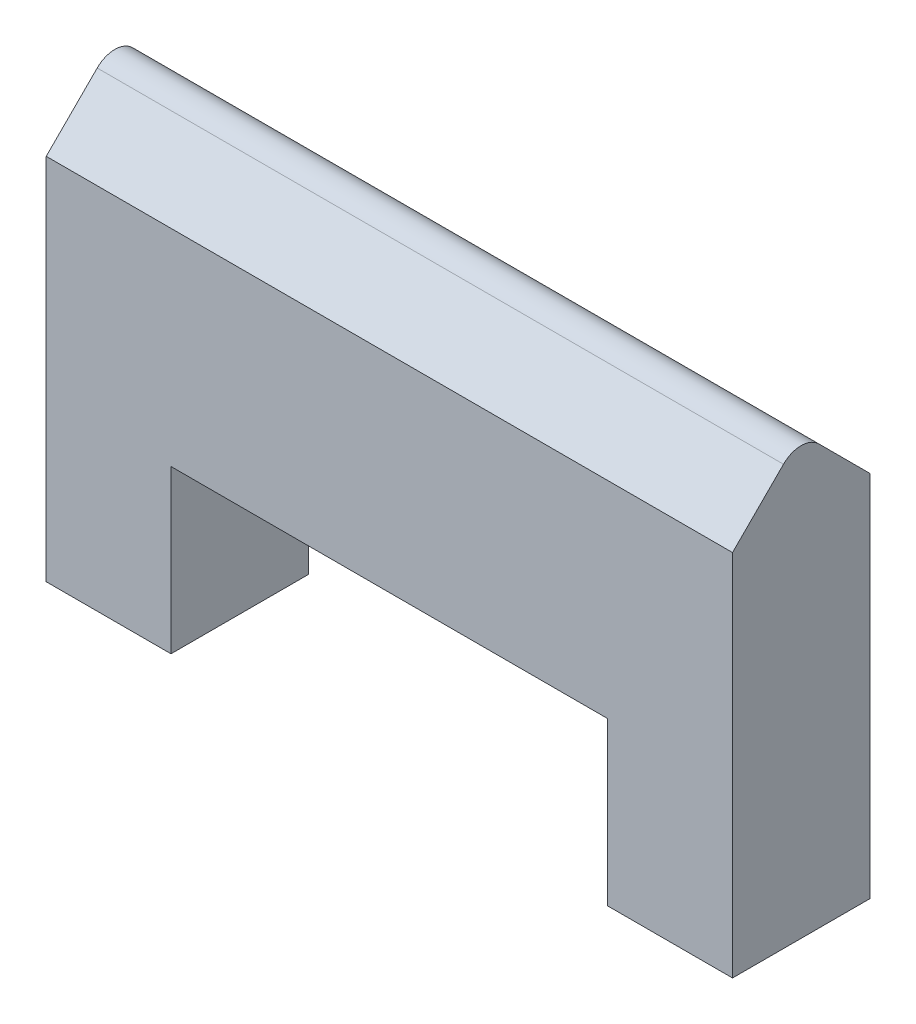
ISO-10303-21;
HEADER;
FILE_DESCRIPTION(('STEP AP214'),'2;1');
FILE_NAME('part.step','',(''),(''),'','','');
FILE_SCHEMA(('AUTOMOTIVE_DESIGN { 1 0 10303 214 1 1 1 1 }'));
ENDSEC;
DATA;
#1=APPLICATION_CONTEXT('core data for automotive mechanical design processes');
#2=APPLICATION_PROTOCOL_DEFINITION('international standard','automotive_design',2000,#1);
#3=PRODUCT_CONTEXT('',#1,'mechanical');
#4=PRODUCT('Part','Part','',(#3));
#5=PRODUCT_RELATED_PRODUCT_CATEGORY('part','',(#4));
#6=PRODUCT_DEFINITION_FORMATION('','',#4);
#7=PRODUCT_DEFINITION_CONTEXT('part definition',#1,'design');
#8=PRODUCT_DEFINITION('design','',#6,#7);
#9=PRODUCT_DEFINITION_SHAPE('','',#8);
#10=(LENGTH_UNIT() NAMED_UNIT(*) SI_UNIT(.MILLI.,.METRE.));
#11=(NAMED_UNIT(*) PLANE_ANGLE_UNIT() SI_UNIT($,.RADIAN.));
#12=(NAMED_UNIT(*) SI_UNIT($,.STERADIAN.) SOLID_ANGLE_UNIT());
#13=UNCERTAINTY_MEASURE_WITH_UNIT(LENGTH_MEASURE(1.E-05),#10,'distance_accuracy_value','');
#14=(GEOMETRIC_REPRESENTATION_CONTEXT(3) GLOBAL_UNCERTAINTY_ASSIGNED_CONTEXT((#13)) GLOBAL_UNIT_ASSIGNED_CONTEXT((#10,
#11,#12)) REPRESENTATION_CONTEXT('',''));
#15=CARTESIAN_POINT('',(0.,0.,0.));
#16=DIRECTION('',(0.,0.,1.));
#17=DIRECTION('',(1.,0.,0.));
#18=AXIS2_PLACEMENT_3D('',#15,#16,#17);
#19=CARTESIAN_POINT('',(0.,0.,5.5));
#20=DIRECTION('',(1.,0.,0.));
#21=DIRECTION('',(0.,0.,-1.));
#22=AXIS2_PLACEMENT_3D('',#19,#20,#21);
#23=PLANE('',#22);
#24=DIRECTION('',(0.,-1.,0.));
#25=VECTOR('',#24,1.);
#26=CARTESIAN_POINT('',(0.,0.,5.5));
#27=LINE('',#26,#25);
#28=CARTESIAN_POINT('',(0.,29.5284271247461,5.5));
#29=VERTEX_POINT('',#28);
#30=CARTESIAN_POINT('',(0.,0.,5.5));
#31=VERTEX_POINT('',#30);
#32=EDGE_CURVE('E164',#29,#31,#27,.T.);
#33=ORIENTED_EDGE('',*,*,#32,.F.);
#34=DIRECTION('',(0.,0.707106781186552,-0.707106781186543));
#35=VECTOR('',#34,1.);
#36=CARTESIAN_POINT('',(0.,33.6142135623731,1.4142135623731));
#37=LINE('',#36,#35);
#38=CARTESIAN_POINT('',(0.,33.6142135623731,1.4142135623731));
#39=VERTEX_POINT('',#38);
#40=EDGE_CURVE('E117',#29,#39,#37,.T.);
#41=ORIENTED_EDGE('',*,*,#40,.T.);
#42=CARTESIAN_POINT('',(0.,32.2,0.));
#43=DIRECTION('',(-1.,0.,0.));
#44=DIRECTION('',(0.,0.,-1.));
#45=AXIS2_PLACEMENT_3D('',#42,#43,#44);
#46=CIRCLE('',#45,2.);
#47=CARTESIAN_POINT('',(0.,33.6142135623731,-1.41421356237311));
#48=VERTEX_POINT('',#47);
#49=EDGE_CURVE('E134',#39,#48,#46,.T.);
#50=ORIENTED_EDGE('',*,*,#49,.T.);
#51=DIRECTION('',(0.,-0.707106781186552,-0.707106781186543));
#52=VECTOR('',#51,1.);
#53=CARTESIAN_POINT('',(0.,29.5284271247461,-5.5));
#54=LINE('',#53,#52);
#55=CARTESIAN_POINT('',(0.,29.5284271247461,-5.5));
#56=VERTEX_POINT('',#55);
#57=EDGE_CURVE('E112',#48,#56,#54,.T.);
#58=ORIENTED_EDGE('',*,*,#57,.T.);
#59=DIRECTION('',(0.,-1.,0.));
#60=VECTOR('',#59,1.);
#61=CARTESIAN_POINT('',(0.,0.,-5.5));
#62=LINE('',#61,#60);
#63=CARTESIAN_POINT('',(0.,0.,-5.5));
#64=VERTEX_POINT('',#63);
#65=EDGE_CURVE('E151',#56,#64,#62,.T.);
#66=ORIENTED_EDGE('',*,*,#65,.T.);
#67=DIRECTION('',(0.,0.,-1.));
#68=VECTOR('',#67,1.);
#69=CARTESIAN_POINT('',(0.,0.,5.5));
#70=LINE('',#69,#68);
#71=EDGE_CURVE('E11',#31,#64,#70,.T.);
#72=ORIENTED_EDGE('',*,*,#71,.F.);
#73=EDGE_LOOP('',(#33,#41,#50,#58,#66,#72));
#74=FACE_BOUND('',#73,.T.);
#75=ADVANCED_FACE('F30',(#74),#23,.F.);
#76=CARTESIAN_POINT('',(0.,0.,5.5));
#77=DIRECTION('',(0.,1.,0.));
#78=DIRECTION('',(0.,0.,1.));
#79=AXIS2_PLACEMENT_3D('',#76,#77,#78);
#80=PLANE('',#79);
#81=DIRECTION('',(1.,0.,0.));
#82=VECTOR('',#81,1.);
#83=CARTESIAN_POINT('',(0.,0.,-5.5));
#84=LINE('',#83,#82);
#85=CARTESIAN_POINT('',(9.99999999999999,0.,-5.5));
#86=VERTEX_POINT('',#85);
#87=EDGE_CURVE('E153',#64,#86,#84,.T.);
#88=ORIENTED_EDGE('',*,*,#87,.T.);
#89=DIRECTION('',(0.,0.,-1.));
#90=VECTOR('',#89,1.);
#91=CARTESIAN_POINT('',(9.99999999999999,0.,5.5));
#92=LINE('',#91,#90);
#93=CARTESIAN_POINT('',(9.99999999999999,0.,5.5));
#94=VERTEX_POINT('',#93);
#95=EDGE_CURVE('E37',#94,#86,#92,.T.);
#96=ORIENTED_EDGE('',*,*,#95,.F.);
#97=DIRECTION('',(1.,0.,0.));
#98=VECTOR('',#97,1.);
#99=CARTESIAN_POINT('',(0.,0.,5.5));
#100=LINE('',#99,#98);
#101=EDGE_CURVE('E166',#31,#94,#100,.T.);
#102=ORIENTED_EDGE('',*,*,#101,.F.);
#103=ORIENTED_EDGE('',*,*,#71,.T.);
#104=EDGE_LOOP('',(#88,#96,#102,#103));
#105=FACE_BOUND('',#104,.T.);
#106=ADVANCED_FACE('F215',(#105),#80,.F.);
#107=CARTESIAN_POINT('',(9.99999999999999,0.,5.5));
#108=DIRECTION('',(-1.,0.,0.));
#109=DIRECTION('',(0.,0.,1.));
#110=AXIS2_PLACEMENT_3D('',#107,#108,#109);
#111=PLANE('',#110);
#112=DIRECTION('',(0.,1.,0.));
#113=VECTOR('',#112,1.);
#114=CARTESIAN_POINT('',(9.99999999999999,0.,-5.5));
#115=LINE('',#114,#113);
#116=CARTESIAN_POINT('',(9.99999999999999,13.,-5.5));
#117=VERTEX_POINT('',#116);
#118=EDGE_CURVE('E155',#86,#117,#115,.T.);
#119=ORIENTED_EDGE('',*,*,#118,.T.);
#120=DIRECTION('',(0.,0.,-1.));
#121=VECTOR('',#120,1.);
#122=CARTESIAN_POINT('',(9.99999999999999,13.,5.5));
#123=LINE('',#122,#121);
#124=CARTESIAN_POINT('',(9.99999999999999,13.,5.5));
#125=VERTEX_POINT('',#124);
#126=EDGE_CURVE('E185',#125,#117,#123,.T.);
#127=ORIENTED_EDGE('',*,*,#126,.F.);
#128=DIRECTION('',(0.,1.,0.));
#129=VECTOR('',#128,1.);
#130=CARTESIAN_POINT('',(9.99999999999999,0.,5.5));
#131=LINE('',#130,#129);
#132=EDGE_CURVE('E168',#94,#125,#131,.T.);
#133=ORIENTED_EDGE('',*,*,#132,.F.);
#134=ORIENTED_EDGE('',*,*,#95,.T.);
#135=EDGE_LOOP('',(#119,#127,#133,#134));
#136=FACE_BOUND('',#135,.T.);
#137=ADVANCED_FACE('F192',(#136),#111,.F.);
#138=CARTESIAN_POINT('',(9.99999999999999,13.,5.5));
#139=DIRECTION('',(0.,1.,0.));
#140=DIRECTION('',(0.,0.,1.));
#141=AXIS2_PLACEMENT_3D('',#138,#139,#140);
#142=PLANE('',#141);
#143=CARTESIAN_POINT('',(27.5,13.,0.));
#144=DIRECTION('',(0.,-1.,0.));
#145=DIRECTION('',(0.,0.,-1.));
#146=AXIS2_PLACEMENT_3D('',#143,#144,#145);
#147=CIRCLE('',#146,2.5);
#148=CARTESIAN_POINT('',(27.5,13.,-2.5));
#149=VERTEX_POINT('',#148);
#150=EDGE_CURVE('E148',#149,#149,#147,.T.);
#151=ORIENTED_EDGE('',*,*,#150,.F.);
#152=EDGE_LOOP('',(#151));
#153=FACE_BOUND('',#152,.T.);
#154=DIRECTION('',(1.,0.,0.));
#155=VECTOR('',#154,1.);
#156=CARTESIAN_POINT('',(9.99999999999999,13.,-5.5));
#157=LINE('',#156,#155);
#158=CARTESIAN_POINT('',(45.,13.,-5.5));
#159=VERTEX_POINT('',#158);
#160=EDGE_CURVE('E157',#117,#159,#157,.T.);
#161=ORIENTED_EDGE('',*,*,#160,.T.);
#162=DIRECTION('',(0.,0.,-1.));
#163=VECTOR('',#162,1.);
#164=CARTESIAN_POINT('',(45.,13.,5.5));
#165=LINE('',#164,#163);
#166=CARTESIAN_POINT('',(45.,13.,5.5));
#167=VERTEX_POINT('',#166);
#168=EDGE_CURVE('E182',#167,#159,#165,.T.);
#169=ORIENTED_EDGE('',*,*,#168,.F.);
#170=DIRECTION('',(1.,0.,0.));
#171=VECTOR('',#170,1.);
#172=CARTESIAN_POINT('',(9.99999999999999,13.,5.5));
#173=LINE('',#172,#171);
#174=EDGE_CURVE('E170',#125,#167,#173,.T.);
#175=ORIENTED_EDGE('',*,*,#174,.F.);
#176=ORIENTED_EDGE('',*,*,#126,.T.);
#177=EDGE_LOOP('',(#161,#169,#175,#176));
#178=FACE_BOUND('',#177,.T.);
#179=ADVANCED_FACE('F205',(#153,#178),#142,.F.);
#180=CARTESIAN_POINT('',(45.,0.,5.5));
#181=DIRECTION('',(1.,0.,0.));
#182=DIRECTION('',(0.,0.,-1.));
#183=AXIS2_PLACEMENT_3D('',#180,#181,#182);
#184=PLANE('',#183);
#185=DIRECTION('',(0.,-1.,0.));
#186=VECTOR('',#185,1.);
#187=CARTESIAN_POINT('',(45.,0.,-5.5));
#188=LINE('',#187,#186);
#189=CARTESIAN_POINT('',(45.,0.,-5.5));
#190=VERTEX_POINT('',#189);
#191=EDGE_CURVE('E159',#159,#190,#188,.T.);
#192=ORIENTED_EDGE('',*,*,#191,.T.);
#193=DIRECTION('',(0.,0.,-1.));
#194=VECTOR('',#193,1.);
#195=CARTESIAN_POINT('',(45.,0.,5.5));
#196=LINE('',#195,#194);
#197=CARTESIAN_POINT('',(45.,0.,5.5));
#198=VERTEX_POINT('',#197);
#199=EDGE_CURVE('E179',#198,#190,#196,.T.);
#200=ORIENTED_EDGE('',*,*,#199,.F.);
#201=DIRECTION('',(0.,-1.,0.));
#202=VECTOR('',#201,1.);
#203=CARTESIAN_POINT('',(45.,0.,5.5));
#204=LINE('',#203,#202);
#205=EDGE_CURVE('E172',#167,#198,#204,.T.);
#206=ORIENTED_EDGE('',*,*,#205,.F.);
#207=ORIENTED_EDGE('',*,*,#168,.T.);
#208=EDGE_LOOP('',(#192,#200,#206,#207));
#209=FACE_BOUND('',#208,.T.);
#210=ADVANCED_FACE('F209',(#209),#184,.F.);
#211=CARTESIAN_POINT('',(45.,0.,5.5));
#212=DIRECTION('',(0.,1.,0.));
#213=DIRECTION('',(0.,0.,1.));
#214=AXIS2_PLACEMENT_3D('',#211,#212,#213);
#215=PLANE('',#214);
#216=DIRECTION('',(1.,0.,0.));
#217=VECTOR('',#216,1.);
#218=CARTESIAN_POINT('',(45.,0.,-5.5));
#219=LINE('',#218,#217);
#220=CARTESIAN_POINT('',(55.,0.,-5.5));
#221=VERTEX_POINT('',#220);
#222=EDGE_CURVE('E161',#190,#221,#219,.T.);
#223=ORIENTED_EDGE('',*,*,#222,.T.);
#224=DIRECTION('',(0.,0.,-1.));
#225=VECTOR('',#224,1.);
#226=CARTESIAN_POINT('',(55.,0.,5.5));
#227=LINE('',#226,#225);
#228=CARTESIAN_POINT('',(55.,0.,5.5));
#229=VERTEX_POINT('',#228);
#230=EDGE_CURVE('E177',#229,#221,#227,.T.);
#231=ORIENTED_EDGE('',*,*,#230,.F.);
#232=DIRECTION('',(1.,0.,0.));
#233=VECTOR('',#232,1.);
#234=CARTESIAN_POINT('',(45.,0.,5.5));
#235=LINE('',#234,#233);
#236=EDGE_CURVE('E52',#198,#229,#235,.T.);
#237=ORIENTED_EDGE('',*,*,#236,.F.);
#238=ORIENTED_EDGE('',*,*,#199,.T.);
#239=EDGE_LOOP('',(#223,#231,#237,#238));
#240=FACE_BOUND('',#239,.T.);
#241=ADVANCED_FACE('F218',(#240),#215,.F.);
#242=CARTESIAN_POINT('',(55.,0.,5.5));
#243=DIRECTION('',(-1.,0.,0.));
#244=DIRECTION('',(0.,0.,1.));
#245=AXIS2_PLACEMENT_3D('',#242,#243,#244);
#246=PLANE('',#245);
#247=CARTESIAN_POINT('',(55.,32.2,0.));
#248=DIRECTION('',(-1.,0.,0.));
#249=DIRECTION('',(0.,0.,-1.));
#250=AXIS2_PLACEMENT_3D('',#247,#248,#249);
#251=CIRCLE('',#250,2.);
#252=CARTESIAN_POINT('',(55.,33.6142135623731,1.4142135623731));
#253=VERTEX_POINT('',#252);
#254=CARTESIAN_POINT('',(55.,33.6142135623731,-1.41421356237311));
#255=VERTEX_POINT('',#254);
#256=EDGE_CURVE('E120',#253,#255,#251,.T.);
#257=ORIENTED_EDGE('',*,*,#256,.F.);
#258=DIRECTION('',(0.,0.707106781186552,-0.707106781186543));
#259=VECTOR('',#258,1.);
#260=CARTESIAN_POINT('',(55.,33.6142135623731,1.4142135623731));
#261=LINE('',#260,#259);
#262=CARTESIAN_POINT('',(55.,29.5284271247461,5.5));
#263=VERTEX_POINT('',#262);
#264=EDGE_CURVE('E132',#263,#253,#261,.T.);
#265=ORIENTED_EDGE('',*,*,#264,.F.);
#266=DIRECTION('',(0.,1.,0.));
#267=VECTOR('',#266,1.);
#268=CARTESIAN_POINT('',(55.,0.,5.5));
#269=LINE('',#268,#267);
#270=EDGE_CURVE('E175',#229,#263,#269,.T.);
#271=ORIENTED_EDGE('',*,*,#270,.F.);
#272=ORIENTED_EDGE('',*,*,#230,.T.);
#273=DIRECTION('',(0.,1.,0.));
#274=VECTOR('',#273,1.);
#275=CARTESIAN_POINT('',(55.,0.,-5.5));
#276=LINE('',#275,#274);
#277=CARTESIAN_POINT('',(55.,29.5284271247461,-5.5));
#278=VERTEX_POINT('',#277);
#279=EDGE_CURVE('E131',#221,#278,#276,.T.);
#280=ORIENTED_EDGE('',*,*,#279,.T.);
#281=DIRECTION('',(0.,-0.707106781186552,-0.707106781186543));
#282=VECTOR('',#281,1.);
#283=CARTESIAN_POINT('',(55.,29.5284271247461,-5.5));
#284=LINE('',#283,#282);
#285=EDGE_CURVE('E44',#255,#278,#284,.T.);
#286=ORIENTED_EDGE('',*,*,#285,.F.);
#287=EDGE_LOOP('',(#257,#265,#271,#272,#280,#286));
#288=FACE_BOUND('',#287,.T.);
#289=ADVANCED_FACE('F128',(#288),#246,.F.);
#290=CARTESIAN_POINT('',(0.,35.,5.5));
#291=DIRECTION('',(0.,0.,-1.));
#292=DIRECTION('',(-1.,0.,0.));
#293=AXIS2_PLACEMENT_3D('',#290,#291,#292);
#294=PLANE('',#293);
#295=ORIENTED_EDGE('',*,*,#270,.T.);
#296=DIRECTION('',(1.,0.,0.));
#297=VECTOR('',#296,1.);
#298=CARTESIAN_POINT('',(0.,29.5284271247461,5.5));
#299=LINE('',#298,#297);
#300=EDGE_CURVE('E143',#29,#263,#299,.T.);
#301=ORIENTED_EDGE('',*,*,#300,.F.);
#302=ORIENTED_EDGE('',*,*,#32,.T.);
#303=ORIENTED_EDGE('',*,*,#101,.T.);
#304=ORIENTED_EDGE('',*,*,#132,.T.);
#305=ORIENTED_EDGE('',*,*,#174,.T.);
#306=ORIENTED_EDGE('',*,*,#205,.T.);
#307=ORIENTED_EDGE('',*,*,#236,.T.);
#308=EDGE_LOOP('',(#295,#301,#302,#303,#304,#305,#306,#307));
#309=FACE_BOUND('',#308,.T.);
#310=ADVANCED_FACE('F211',(#309),#294,.F.);
#311=CARTESIAN_POINT('',(0.,35.,-5.5));
#312=DIRECTION('',(0.,0.,-1.));
#313=DIRECTION('',(-1.,0.,0.));
#314=AXIS2_PLACEMENT_3D('',#311,#312,#313);
#315=PLANE('',#314);
#316=DIRECTION('',(1.,0.,0.));
#317=VECTOR('',#316,1.);
#318=CARTESIAN_POINT('',(0.,29.5284271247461,-5.5));
#319=LINE('',#318,#317);
#320=EDGE_CURVE('E116',#56,#278,#319,.T.);
#321=ORIENTED_EDGE('',*,*,#320,.T.);
#322=ORIENTED_EDGE('',*,*,#279,.F.);
#323=ORIENTED_EDGE('',*,*,#222,.F.);
#324=ORIENTED_EDGE('',*,*,#191,.F.);
#325=ORIENTED_EDGE('',*,*,#160,.F.);
#326=ORIENTED_EDGE('',*,*,#118,.F.);
#327=ORIENTED_EDGE('',*,*,#87,.F.);
#328=ORIENTED_EDGE('',*,*,#65,.F.);
#329=EDGE_LOOP('',(#321,#322,#323,#324,#325,#326,#327,#328));
#330=FACE_BOUND('',#329,.T.);
#331=ADVANCED_FACE('F199',(#330),#315,.T.);
#332=CARTESIAN_POINT('',(27.5,13.,0.));
#333=DIRECTION('',(0.,-1.,0.));
#334=DIRECTION('',(0.,0.,-1.));
#335=AXIS2_PLACEMENT_3D('',#332,#333,#334);
#336=CYLINDRICAL_SURFACE('',#335,2.5);
#337=CARTESIAN_POINT('',(27.5,23.,0.));
#338=DIRECTION('',(0.,-1.,0.));
#339=DIRECTION('',(0.,0.,-1.));
#340=AXIS2_PLACEMENT_3D('',#337,#338,#339);
#341=CIRCLE('',#340,2.5);
#342=CARTESIAN_POINT('',(27.5,23.,-2.5));
#343=VERTEX_POINT('',#342);
#344=EDGE_CURVE('E142',#343,#343,#341,.T.);
#345=ORIENTED_EDGE('',*,*,#344,.F.);
#346=EDGE_LOOP('',(#345));
#347=FACE_BOUND('',#346,.T.);
#348=ORIENTED_EDGE('',*,*,#150,.T.);
#349=EDGE_LOOP('',(#348));
#350=FACE_BOUND('',#349,.T.);
#351=ADVANCED_FACE('F253',(#347,#350),#336,.F.);
#352=CARTESIAN_POINT('',(27.5,23.,0.));
#353=DIRECTION('',(0.,-1.,0.));
#354=DIRECTION('',(0.,0.,-1.));
#355=AXIS2_PLACEMENT_3D('',#352,#353,#354);
#356=CONICAL_SURFACE('',#355,2.5,1.02974425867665);
#357=CARTESIAN_POINT('',(27.5,24.5021515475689,0.));
#358=VERTEX_POINT('',#357);
#359=VERTEX_LOOP('',#358);
#360=FACE_BOUND('',#359,.T.);
#361=ORIENTED_EDGE('',*,*,#344,.T.);
#362=EDGE_LOOP('',(#361));
#363=FACE_BOUND('',#362,.T.);
#364=ADVANCED_FACE('F229',(#360,#363),#356,.F.);
#365=CARTESIAN_POINT('',(0.,32.2,0.));
#366=DIRECTION('',(1.,0.,0.));
#367=DIRECTION('',(0.,0.,-1.));
#368=AXIS2_PLACEMENT_3D('',#365,#366,#367);
#369=CYLINDRICAL_SURFACE('',#368,2.);
#370=ORIENTED_EDGE('',*,*,#256,.T.);
#371=DIRECTION('',(1.,0.,0.));
#372=VECTOR('',#371,1.);
#373=CARTESIAN_POINT('',(0.,33.6142135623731,-1.41421356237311));
#374=LINE('',#373,#372);
#375=EDGE_CURVE('E108',#48,#255,#374,.T.);
#376=ORIENTED_EDGE('',*,*,#375,.F.);
#377=ORIENTED_EDGE('',*,*,#49,.F.);
#378=DIRECTION('',(1.,0.,0.));
#379=VECTOR('',#378,1.);
#380=CARTESIAN_POINT('',(0.,33.6142135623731,1.4142135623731));
#381=LINE('',#380,#379);
#382=EDGE_CURVE('E122',#39,#253,#381,.T.);
#383=ORIENTED_EDGE('',*,*,#382,.T.);
#384=EDGE_LOOP('',(#370,#376,#377,#383));
#385=FACE_BOUND('',#384,.T.);
#386=ADVANCED_FACE('F121',(#385),#369,.T.);
#387=CARTESIAN_POINT('',(0.,33.6142135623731,1.4142135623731));
#388=DIRECTION('',(0.,-0.707106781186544,-0.707106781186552));
#389=DIRECTION('',(0.,0.707106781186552,-0.707106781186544));
#390=AXIS2_PLACEMENT_3D('',#387,#388,#389);
#391=PLANE('',#390);
#392=ORIENTED_EDGE('',*,*,#264,.T.);
#393=ORIENTED_EDGE('',*,*,#382,.F.);
#394=ORIENTED_EDGE('',*,*,#40,.F.);
#395=ORIENTED_EDGE('',*,*,#300,.T.);
#396=EDGE_LOOP('',(#392,#393,#394,#395));
#397=FACE_BOUND('',#396,.T.);
#398=ADVANCED_FACE('F221',(#397),#391,.F.);
#399=CARTESIAN_POINT('',(0.,29.5284271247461,-5.5));
#400=DIRECTION('',(0.,-0.707106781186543,0.707106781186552));
#401=DIRECTION('',(0.,-0.707106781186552,-0.707106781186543));
#402=AXIS2_PLACEMENT_3D('',#399,#400,#401);
#403=PLANE('',#402);
#404=ORIENTED_EDGE('',*,*,#285,.T.);
#405=ORIENTED_EDGE('',*,*,#320,.F.);
#406=ORIENTED_EDGE('',*,*,#57,.F.);
#407=ORIENTED_EDGE('',*,*,#375,.T.);
#408=EDGE_LOOP('',(#404,#405,#406,#407));
#409=FACE_BOUND('',#408,.T.);
#410=ADVANCED_FACE('F110',(#409),#403,.F.);
#411=CLOSED_SHELL('',(#75,#106,#137,#179,#210,#241,#289,#310,#331,#351,#364,#386,#398,#410));
#412=MANIFOLD_SOLID_BREP('B2',#411);
#413=ADVANCED_BREP_SHAPE_REPRESENTATION('',(#18,#412),#14);
#414=SHAPE_DEFINITION_REPRESENTATION(#9,#413);
ENDSEC;
END-ISO-10303-21;
